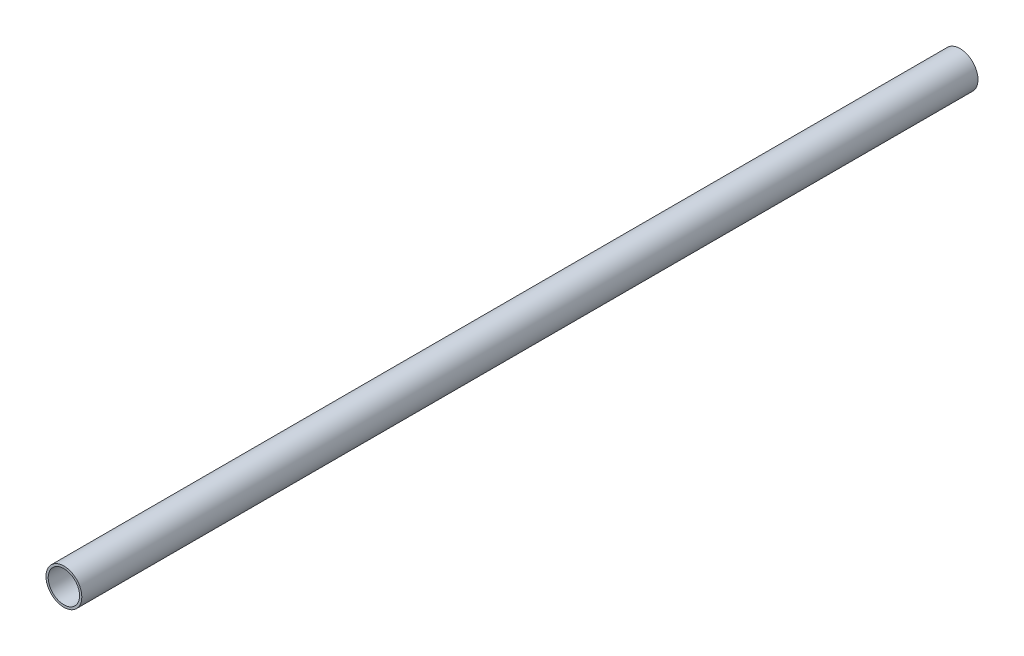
from build123d import *

# Parameters (mm, degrees)
SKETCH_1_R      = 8
SKETCH_1_R_2    = 7
EXTRUDE_1_DEPTH = 400


with BuildPart() as part:
    # Sketch 1 → Extrude 1 (new body)
    with BuildSketch(Plane.XY):
        Circle(SKETCH_1_R)
        Circle(SKETCH_1_R_2, mode=Mode.SUBTRACT)
    extrude(amount=EXTRUDE_1_DEPTH)


solid = part.part
